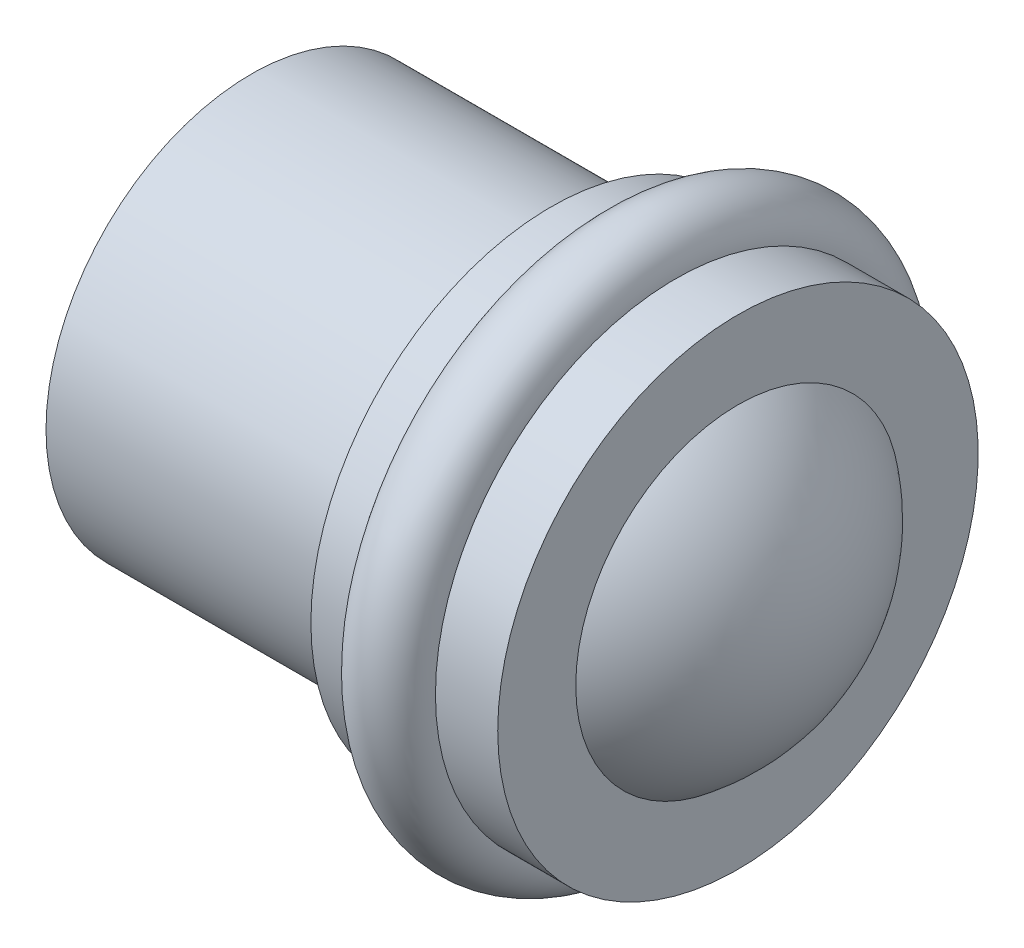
from build123d import *

# Parameters (mm, degrees)
SKETCH2_R = 0.481541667


with BuildPart() as part:
    # Sketch1 → Revolve1 (revolve)
    with BuildSketch(Plane.XY, mode=Mode.PRIVATE) as revolve1_sk:
        with BuildLine():
            Line((-3.5052, 0), (-3.5052, 2.54))
            Line((-3.5052, 2.54), (0.2032, 2.54))
            Line((0.2032, 2.54), (0.2032, 2.9718))
            Line((0.2032, 2.9718), (0.78105, 2.9718))
            ThreePointArc((0.78105, 2.9718), (1.262591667, 2.490258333), (1.744133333, 2.9718))
            Line((1.744133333, 2.9718), (2.5146, 2.9718))
            Line((2.5146, 2.9718), (2.5146, 2.0066))
            ThreePointArc((2.5146, 2.0066), (3.244060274, 1.11889811), (3.5052, 0))
            Line((3.5052, 0), (-3.5052, 0))
        make_face()
    revolve(revolve1_sk.sketch.rotate(Axis((-3.5052, 0, 0), (1, 0, 0)), 90), axis=Axis((-3.5052, 0, 0), (1, 0, 0)))


with BuildPart() as body_2:
    # Sketch2 → Revolve2 (revolve)
    with BuildSketch(Plane.XY):
        with Locations((1.262591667, 2.9718)):
            Circle(SKETCH2_R)
    revolve(axis=Axis((-3.5052, 0, 0), (1, 0, 0)))


solid = Compound([part.part, body_2.part])
